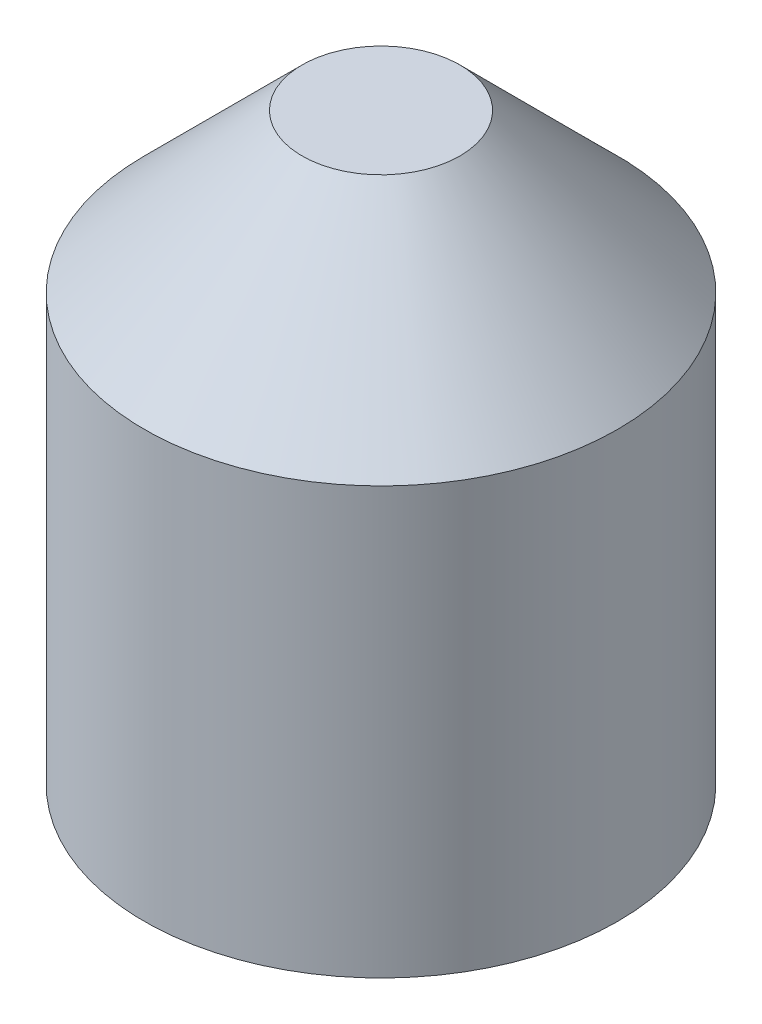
ISO-10303-21;
HEADER;
FILE_DESCRIPTION(('STEP AP214'),'2;1');
FILE_NAME('part.step','',(''),(''),'','','');
FILE_SCHEMA(('AUTOMOTIVE_DESIGN { 1 0 10303 214 1 1 1 1 }'));
ENDSEC;
DATA;
#1=APPLICATION_CONTEXT('core data for automotive mechanical design processes');
#2=APPLICATION_PROTOCOL_DEFINITION('international standard','automotive_design',2000,#1);
#3=PRODUCT_CONTEXT('',#1,'mechanical');
#4=PRODUCT('Part','Part','',(#3));
#5=PRODUCT_RELATED_PRODUCT_CATEGORY('part','',(#4));
#6=PRODUCT_DEFINITION_FORMATION('','',#4);
#7=PRODUCT_DEFINITION_CONTEXT('part definition',#1,'design');
#8=PRODUCT_DEFINITION('design','',#6,#7);
#9=PRODUCT_DEFINITION_SHAPE('','',#8);
#10=(LENGTH_UNIT() NAMED_UNIT(*) SI_UNIT(.MILLI.,.METRE.));
#11=(NAMED_UNIT(*) PLANE_ANGLE_UNIT() SI_UNIT($,.RADIAN.));
#12=(NAMED_UNIT(*) SI_UNIT($,.STERADIAN.) SOLID_ANGLE_UNIT());
#13=UNCERTAINTY_MEASURE_WITH_UNIT(LENGTH_MEASURE(1.E-05),#10,'distance_accuracy_value','');
#14=(GEOMETRIC_REPRESENTATION_CONTEXT(3) GLOBAL_UNCERTAINTY_ASSIGNED_CONTEXT((#13)) GLOBAL_UNIT_ASSIGNED_CONTEXT((#10,
#11,#12)) REPRESENTATION_CONTEXT('',''));
#15=CARTESIAN_POINT('',(0.,0.,0.));
#16=DIRECTION('',(0.,0.,1.));
#17=DIRECTION('',(1.,0.,0.));
#18=AXIS2_PLACEMENT_3D('',#15,#16,#17);
#19=CARTESIAN_POINT('',(9.,47.8,0.));
#20=DIRECTION('',(0.,-1.,0.));
#21=DIRECTION('',(-1.,0.,0.));
#22=AXIS2_PLACEMENT_3D('',#19,#20,#21);
#23=CONICAL_SURFACE('',#22,1.,0.78539816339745);
#24=CARTESIAN_POINT('',(9.,48.3,0.));
#25=DIRECTION('',(0.,-1.,0.));
#26=DIRECTION('',(-1.,0.,0.));
#27=AXIS2_PLACEMENT_3D('',#24,#25,#26);
#28=CIRCLE('',#27,0.5);
#29=CARTESIAN_POINT('',(9.5,48.3,0.));
#30=VERTEX_POINT('',#29);
#31=EDGE_CURVE('E11',#30,#30,#28,.T.);
#32=ORIENTED_EDGE('',*,*,#31,.T.);
#33=DIRECTION('',(0.707106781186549,-0.707106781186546,0.));
#34=VECTOR('',#33,1.);
#35=CARTESIAN_POINT('',(10.,47.8,0.));
#36=LINE('',#35,#34);
#37=CARTESIAN_POINT('',(10.5,47.3,0.));
#38=VERTEX_POINT('',#37);
#39=EDGE_CURVE('E26',#30,#38,#36,.T.);
#40=ORIENTED_EDGE('',*,*,#39,.T.);
#41=CARTESIAN_POINT('',(9.,47.3,0.));
#42=DIRECTION('',(0.,1.,0.));
#43=DIRECTION('',(-1.,0.,0.));
#44=AXIS2_PLACEMENT_3D('',#41,#42,#43);
#45=CIRCLE('',#44,1.5);
#46=EDGE_CURVE('E52',#38,#38,#45,.T.);
#47=ORIENTED_EDGE('',*,*,#46,.T.);
#48=ORIENTED_EDGE('',*,*,#39,.F.);
#49=EDGE_LOOP('',(#32,#40,#47,#48));
#50=FACE_BOUND('',#49,.T.);
#51=ADVANCED_FACE('F16',(#50),#23,.T.);
#52=CARTESIAN_POINT('',(9.,44.6,0.));
#53=DIRECTION('',(0.,1.,0.));
#54=DIRECTION('',(-1.,0.,0.));
#55=AXIS2_PLACEMENT_3D('',#52,#53,#54);
#56=CYLINDRICAL_SURFACE('',#55,1.5);
#57=ORIENTED_EDGE('',*,*,#46,.F.);
#58=DIRECTION('',(0.,-1.,0.));
#59=VECTOR('',#58,1.);
#60=CARTESIAN_POINT('',(10.5,44.6,0.));
#61=LINE('',#60,#59);
#62=CARTESIAN_POINT('',(10.5,44.6,0.));
#63=VERTEX_POINT('',#62);
#64=EDGE_CURVE('E45',#38,#63,#61,.T.);
#65=ORIENTED_EDGE('',*,*,#64,.T.);
#66=CARTESIAN_POINT('',(9.,44.6,0.));
#67=DIRECTION('',(0.,-1.,0.));
#68=DIRECTION('',(-1.,0.,0.));
#69=AXIS2_PLACEMENT_3D('',#66,#67,#68);
#70=CIRCLE('',#69,1.5);
#71=EDGE_CURVE('E44',#63,#63,#70,.T.);
#72=ORIENTED_EDGE('',*,*,#71,.F.);
#73=ORIENTED_EDGE('',*,*,#64,.F.);
#74=EDGE_LOOP('',(#57,#65,#72,#73));
#75=FACE_BOUND('',#74,.T.);
#76=ADVANCED_FACE('F18',(#75),#56,.T.);
#77=CARTESIAN_POINT('',(9.,48.3,0.));
#78=DIRECTION('',(0.,1.,0.));
#79=DIRECTION('',(1.,0.,0.));
#80=AXIS2_PLACEMENT_3D('',#77,#78,#79);
#81=PLANE('',#80);
#82=ORIENTED_EDGE('',*,*,#31,.F.);
#83=EDGE_LOOP('',(#82));
#84=FACE_BOUND('',#83,.T.);
#85=ADVANCED_FACE('F71',(#84),#81,.T.);
#86=CARTESIAN_POINT('',(9.,44.6,0.));
#87=DIRECTION('',(0.,1.,0.));
#88=DIRECTION('',(1.,0.,0.));
#89=AXIS2_PLACEMENT_3D('',#86,#87,#88);
#90=PLANE('',#89);
#91=ORIENTED_EDGE('',*,*,#71,.T.);
#92=EDGE_LOOP('',(#91));
#93=FACE_BOUND('',#92,.T.);
#94=ADVANCED_FACE('F73',(#93),#90,.F.);
#95=CLOSED_SHELL('',(#51,#76,#85,#94));
#96=MANIFOLD_SOLID_BREP('B1',#95);
#97=ADVANCED_BREP_SHAPE_REPRESENTATION('',(#18,#96),#14);
#98=SHAPE_DEFINITION_REPRESENTATION(#9,#97);
ENDSEC;
END-ISO-10303-21;
